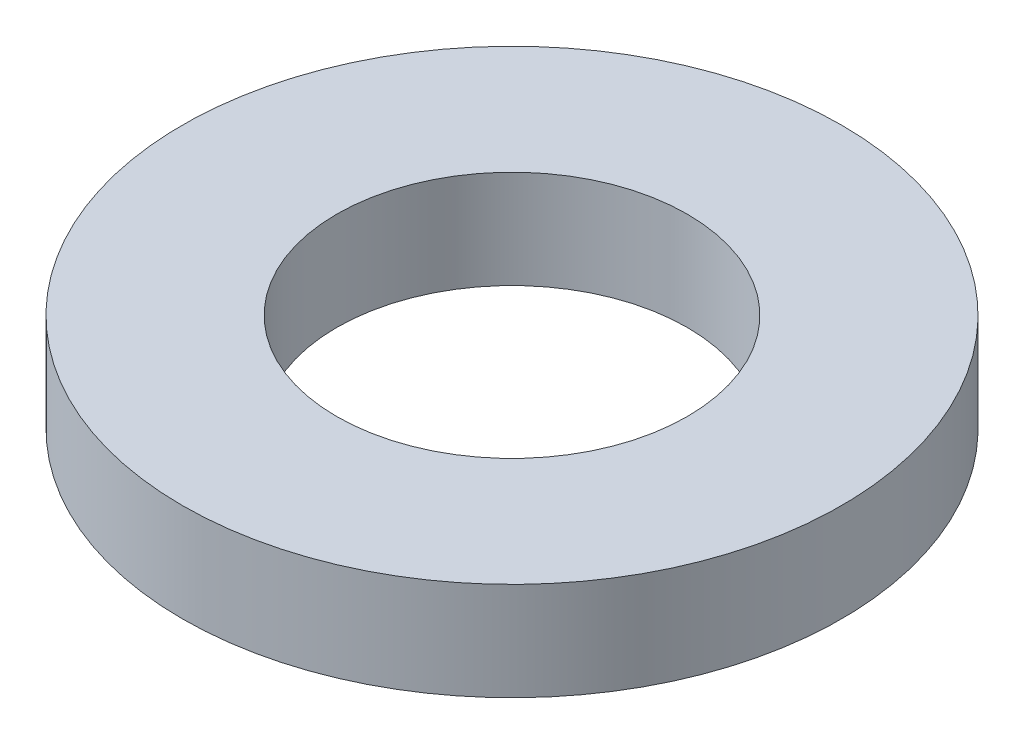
from build123d import *

# Parameters (mm, degrees)
ESQUISSE1_R      = 23.5
ESQUISSE1_R_2    = 12.5
EXTRUSION1_DEPTH = 7


with BuildPart() as part:
    # Esquisse1 → Extrusion1 (new body)
    with BuildSketch(Plane(origin=(0, 0, 0), x_dir=(1, 0, 0), z_dir=(0, 1, 0))):
        with Locations(Location((0, 0, 0), (0, 0, 270))):
            Circle(ESQUISSE1_R)
        with Locations(Location((0, 0, 0), (0, 0, 270))):
            Circle(ESQUISSE1_R_2, mode=Mode.SUBTRACT)
    extrude(amount=-EXTRUSION1_DEPTH)


solid = part.part
